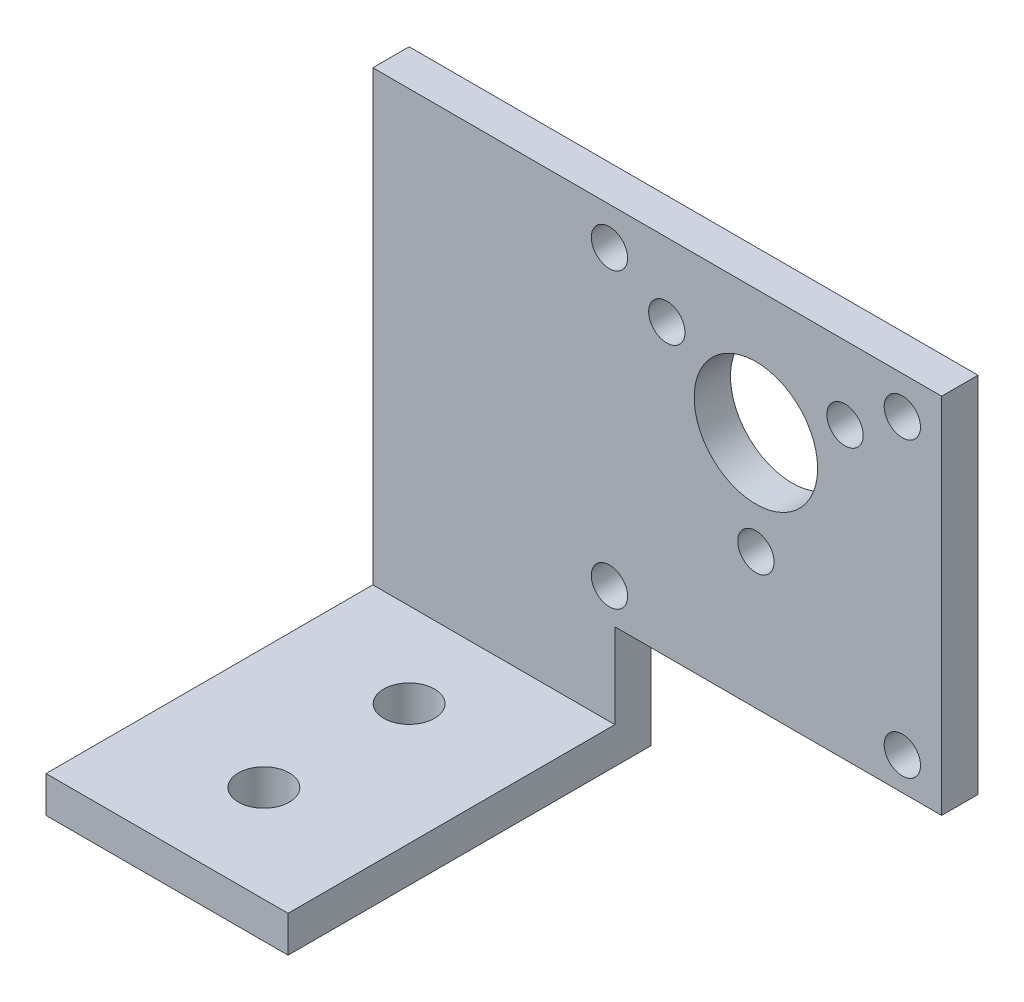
from build123d import *

# Parameters (mm, degrees)
ESQUISSE1_R             = 5.1
ESQUISSE1_R_2           = 1.5
EXTRUSION1_DEPTH        = 3
ESQUISSE2_W             = 20
ESQUISSE2_H             = 3
EXTRUSION2_DEPTH        = 27
ESQUISSE4_R             = 2.1
ENL_V_MAT_EXTRU_1_DEPTH = 58.190230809


with BuildPart() as part:
    # Esquisse1 → Extrusion1 (new body)
    with BuildSketch(Plane.XY):
        Polygon((-11.65, -19.7), (15.35, -19.7), (15.35, 10.3), (-31.65, 10.3), (-31.65, -29.7), (-11.65, -29.7), align=None)
        Circle(ESQUISSE1_R, mode=Mode.SUBTRACT)
        with Locations((-12.1, 7.2)):
            Circle(ESQUISSE1_R_2, mode=Mode.SUBTRACT)
        with Locations((-12.1, -17)):
            Circle(ESQUISSE1_R_2, mode=Mode.SUBTRACT)
        with Locations((12.1, -17)):
            Circle(ESQUISSE1_R_2, mode=Mode.SUBTRACT)
        with Locations((12.1, 7.2)):
            Circle(ESQUISSE1_R_2, mode=Mode.SUBTRACT)
        with Locations((0, -8.5)):
            Circle(ESQUISSE1_R_2, mode=Mode.SUBTRACT)
        with Locations((-7.361215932, 4.25)):
            Circle(ESQUISSE1_R_2, mode=Mode.SUBTRACT)
        with Locations((7.361215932, 4.25)):
            Circle(ESQUISSE1_R_2, mode=Mode.SUBTRACT)
    extrude(amount=EXTRUSION1_DEPTH)

    # Esquisse2 → Extrusion2 (add)
    with BuildSketch(Plane.XY.offset(3)):
        with Locations((-21.65, -28.2)):
            Rectangle(ESQUISSE2_W, ESQUISSE2_H)
    extrude(amount=EXTRUSION2_DEPTH)

    # Esquisse4 → Enl_v. mat.-Extru.1 (cut, through all)
    with BuildSketch(Plane(origin=(0, -26.7, 0), x_dir=(-1, 0, 0), z_dir=(0, 1, 0))):
        with Locations(Location((21.65, 10, 0), (0, 0, 90))):
            Circle(ESQUISSE4_R)
        with Locations(Location((21.65, 22, 0), (0, 0, 90))):
            Circle(ESQUISSE4_R)
    extrude(amount=-ENL_V_MAT_EXTRU_1_DEPTH, mode=Mode.SUBTRACT)


solid = part.part
